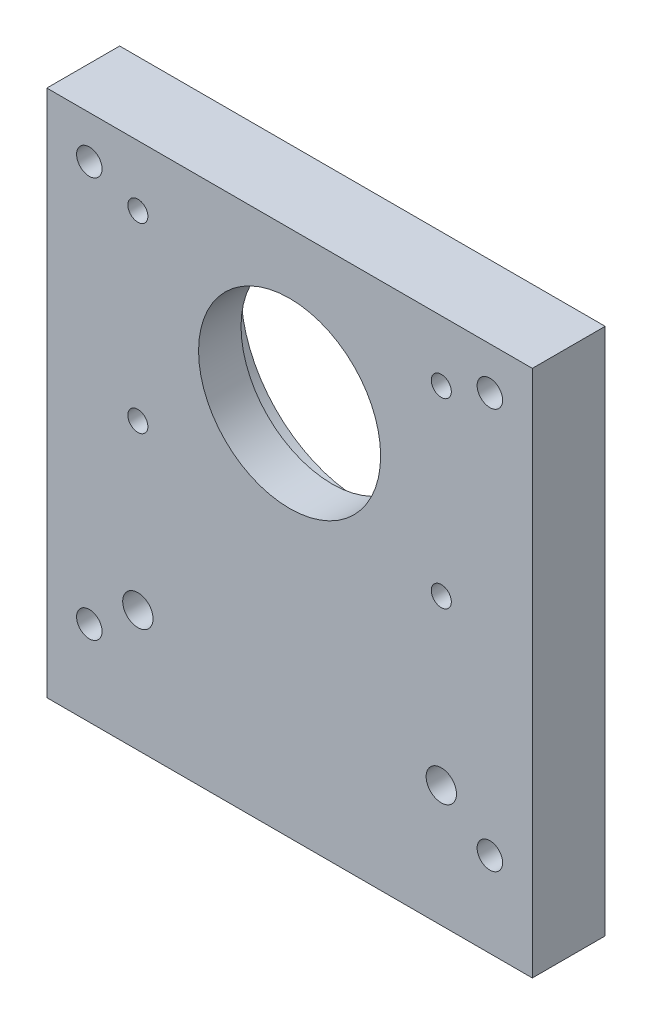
from build123d import *

# Parameters (mm, degrees)
SKETCH_1_W          = 80
SKETCH_1_H          = 87
SKETCH_1_R          = 2.5
SKETCH_1_R_2        = 15
SKETCH_1_R_3        = 1.65
SKETCH_1_R_4        = 2.1
EXTRUDE_1_DEPTH     = 12
SKETCH_3_R          = 20
CUT_EXTRUDE_1_DEPTH = 5


with BuildPart() as part:
    # Sketch 1 → Extrude 1 (new body)
    with BuildSketch(Plane.XY):
        with Locations((40, 43.5)):
            Rectangle(SKETCH_1_W, SKETCH_1_H)
        with Locations((65, 20)):
            Circle(SKETCH_1_R, mode=Mode.SUBTRACT)
        with Locations((15, 20)):
            Circle(SKETCH_1_R, mode=Mode.SUBTRACT)
        with Locations((40, 62)):
            Circle(SKETCH_1_R_2, mode=Mode.SUBTRACT)
        with Locations((65, 47)):
            Circle(SKETCH_1_R_3, mode=Mode.SUBTRACT)
        with Locations((65, 77)):
            Circle(SKETCH_1_R_3, mode=Mode.SUBTRACT)
        with Locations((15, 77)):
            Circle(SKETCH_1_R_3, mode=Mode.SUBTRACT)
        with Locations((15, 47)):
            Circle(SKETCH_1_R_3, mode=Mode.SUBTRACT)
        with Locations((73, 14)):
            Circle(SKETCH_1_R_4, mode=Mode.SUBTRACT)
        with Locations((73, 80)):
            Circle(SKETCH_1_R_4, mode=Mode.SUBTRACT)
        with Locations((7, 14)):
            Circle(SKETCH_1_R_4, mode=Mode.SUBTRACT)
        with Locations((7, 80)):
            Circle(SKETCH_1_R_4, mode=Mode.SUBTRACT)
    extrude(amount=EXTRUDE_1_DEPTH)

    # Sketch 3 → Cut-Extrude 1 (cut)
    with BuildSketch(Plane(origin=(0, 0, 0), x_dir=(-1, 0, 0), z_dir=(0, 0, -1))):
        with Locations((-40, 62)):
            Circle(SKETCH_3_R)
    extrude(amount=-CUT_EXTRUDE_1_DEPTH, mode=Mode.SUBTRACT)


solid = part.part
